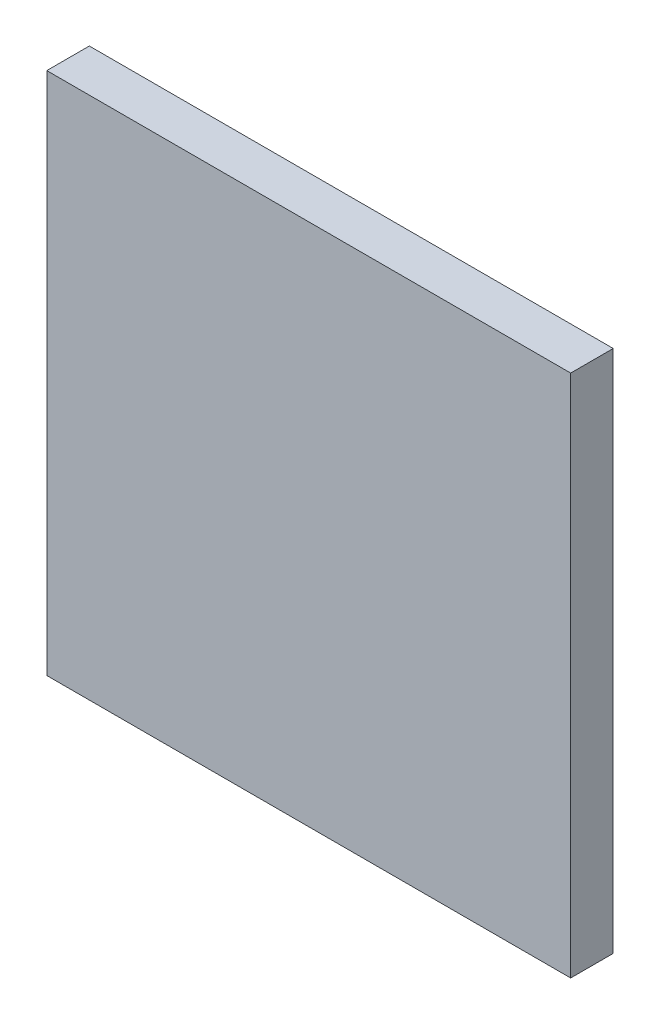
ISO-10303-21;
HEADER;
FILE_DESCRIPTION(('STEP AP214'),'2;1');
FILE_NAME('part.step','',(''),(''),'','','');
FILE_SCHEMA(('AUTOMOTIVE_DESIGN { 1 0 10303 214 1 1 1 1 }'));
ENDSEC;
DATA;
#1=APPLICATION_CONTEXT('core data for automotive mechanical design processes');
#2=APPLICATION_PROTOCOL_DEFINITION('international standard','automotive_design',2000,#1);
#3=PRODUCT_CONTEXT('',#1,'mechanical');
#4=PRODUCT('Part','Part','',(#3));
#5=PRODUCT_RELATED_PRODUCT_CATEGORY('part','',(#4));
#6=PRODUCT_DEFINITION_FORMATION('','',#4);
#7=PRODUCT_DEFINITION_CONTEXT('part definition',#1,'design');
#8=PRODUCT_DEFINITION('design','',#6,#7);
#9=PRODUCT_DEFINITION_SHAPE('','',#8);
#10=(LENGTH_UNIT() NAMED_UNIT(*) SI_UNIT(.MILLI.,.METRE.));
#11=(NAMED_UNIT(*) PLANE_ANGLE_UNIT() SI_UNIT($,.RADIAN.));
#12=(NAMED_UNIT(*) SI_UNIT($,.STERADIAN.) SOLID_ANGLE_UNIT());
#13=UNCERTAINTY_MEASURE_WITH_UNIT(LENGTH_MEASURE(1.E-05),#10,'distance_accuracy_value','');
#14=(GEOMETRIC_REPRESENTATION_CONTEXT(3) GLOBAL_UNCERTAINTY_ASSIGNED_CONTEXT((#13)) GLOBAL_UNIT_ASSIGNED_CONTEXT((#10,
#11,#12)) REPRESENTATION_CONTEXT('',''));
#15=CARTESIAN_POINT('',(0.,0.,0.));
#16=DIRECTION('',(0.,0.,1.));
#17=DIRECTION('',(1.,0.,0.));
#18=AXIS2_PLACEMENT_3D('',#15,#16,#17);
#19=CARTESIAN_POINT('',(4.,4.,0.65));
#20=DIRECTION('',(-1.,0.,0.));
#21=DIRECTION('',(0.,-1.,0.));
#22=AXIS2_PLACEMENT_3D('',#19,#20,#21);
#23=PLANE('',#22);
#24=DIRECTION('',(0.,1.,0.));
#25=VECTOR('',#24,1.);
#26=CARTESIAN_POINT('',(4.,4.,0.));
#27=LINE('',#26,#25);
#28=CARTESIAN_POINT('',(4.,-4.,0.));
#29=VERTEX_POINT('',#28);
#30=CARTESIAN_POINT('',(4.,4.,0.));
#31=VERTEX_POINT('',#30);
#32=EDGE_CURVE('E102',#29,#31,#27,.T.);
#33=ORIENTED_EDGE('',*,*,#32,.T.);
#34=DIRECTION('',(0.,0.,-1.));
#35=VECTOR('',#34,1.);
#36=CARTESIAN_POINT('',(4.,4.,0.65));
#37=LINE('',#36,#35);
#38=CARTESIAN_POINT('',(4.,4.,0.65));
#39=VERTEX_POINT('',#38);
#40=EDGE_CURVE('E11',#39,#31,#37,.T.);
#41=ORIENTED_EDGE('',*,*,#40,.F.);
#42=DIRECTION('',(0.,1.,0.));
#43=VECTOR('',#42,1.);
#44=CARTESIAN_POINT('',(4.,4.,0.65));
#45=LINE('',#44,#43);
#46=CARTESIAN_POINT('',(4.,-4.,0.65));
#47=VERTEX_POINT('',#46);
#48=EDGE_CURVE('E90',#47,#39,#45,.T.);
#49=ORIENTED_EDGE('',*,*,#48,.F.);
#50=DIRECTION('',(0.,0.,-1.));
#51=VECTOR('',#50,1.);
#52=CARTESIAN_POINT('',(4.,-4.,0.65));
#53=LINE('',#52,#51);
#54=EDGE_CURVE('E98',#47,#29,#53,.T.);
#55=ORIENTED_EDGE('',*,*,#54,.T.);
#56=EDGE_LOOP('',(#33,#41,#49,#55));
#57=FACE_BOUND('',#56,.T.);
#58=ADVANCED_FACE('F39',(#57),#23,.F.);
#59=CARTESIAN_POINT('',(-4.,4.,0.65));
#60=DIRECTION('',(0.,-1.,0.));
#61=DIRECTION('',(0.,0.,-1.));
#62=AXIS2_PLACEMENT_3D('',#59,#60,#61);
#63=PLANE('',#62);
#64=DIRECTION('',(-1.,0.,0.));
#65=VECTOR('',#64,1.);
#66=CARTESIAN_POINT('',(-4.,4.,0.));
#67=LINE('',#66,#65);
#68=CARTESIAN_POINT('',(-4.,4.,0.));
#69=VERTEX_POINT('',#68);
#70=EDGE_CURVE('E94',#31,#69,#67,.T.);
#71=ORIENTED_EDGE('',*,*,#70,.T.);
#72=DIRECTION('',(0.,0.,-1.));
#73=VECTOR('',#72,1.);
#74=CARTESIAN_POINT('',(-4.,4.,0.65));
#75=LINE('',#74,#73);
#76=CARTESIAN_POINT('',(-4.,4.,0.65));
#77=VERTEX_POINT('',#76);
#78=EDGE_CURVE('E47',#77,#69,#75,.T.);
#79=ORIENTED_EDGE('',*,*,#78,.F.);
#80=DIRECTION('',(-1.,0.,0.));
#81=VECTOR('',#80,1.);
#82=CARTESIAN_POINT('',(-4.,4.,0.65));
#83=LINE('',#82,#81);
#84=EDGE_CURVE('E85',#39,#77,#83,.T.);
#85=ORIENTED_EDGE('',*,*,#84,.F.);
#86=ORIENTED_EDGE('',*,*,#40,.T.);
#87=EDGE_LOOP('',(#71,#79,#85,#86));
#88=FACE_BOUND('',#87,.T.);
#89=ADVANCED_FACE('F93',(#88),#63,.F.);
#90=CARTESIAN_POINT('',(-4.,4.,0.65));
#91=DIRECTION('',(1.,0.,0.));
#92=DIRECTION('',(0.,0.,-1.));
#93=AXIS2_PLACEMENT_3D('',#90,#91,#92);
#94=PLANE('',#93);
#95=DIRECTION('',(0.,-1.,0.));
#96=VECTOR('',#95,1.);
#97=CARTESIAN_POINT('',(-4.,4.,0.));
#98=LINE('',#97,#96);
#99=CARTESIAN_POINT('',(-4.,-4.,0.));
#100=VERTEX_POINT('',#99);
#101=EDGE_CURVE('E72',#69,#100,#98,.T.);
#102=ORIENTED_EDGE('',*,*,#101,.T.);
#103=DIRECTION('',(0.,0.,-1.));
#104=VECTOR('',#103,1.);
#105=CARTESIAN_POINT('',(-4.,-4.,0.65));
#106=LINE('',#105,#104);
#107=CARTESIAN_POINT('',(-4.,-4.,0.65));
#108=VERTEX_POINT('',#107);
#109=EDGE_CURVE('E95',#108,#100,#106,.T.);
#110=ORIENTED_EDGE('',*,*,#109,.F.);
#111=DIRECTION('',(0.,-1.,0.));
#112=VECTOR('',#111,1.);
#113=CARTESIAN_POINT('',(-4.,4.,0.65));
#114=LINE('',#113,#112);
#115=EDGE_CURVE('E88',#77,#108,#114,.T.);
#116=ORIENTED_EDGE('',*,*,#115,.F.);
#117=ORIENTED_EDGE('',*,*,#78,.T.);
#118=EDGE_LOOP('',(#102,#110,#116,#117));
#119=FACE_BOUND('',#118,.T.);
#120=ADVANCED_FACE('F96',(#119),#94,.F.);
#121=CARTESIAN_POINT('',(-4.,-4.,0.65));
#122=DIRECTION('',(0.,1.,0.));
#123=DIRECTION('',(-1.,0.,0.));
#124=AXIS2_PLACEMENT_3D('',#121,#122,#123);
#125=PLANE('',#124);
#126=DIRECTION('',(1.,0.,0.));
#127=VECTOR('',#126,1.);
#128=CARTESIAN_POINT('',(-4.,-4.,0.));
#129=LINE('',#128,#127);
#130=EDGE_CURVE('E78',#100,#29,#129,.T.);
#131=ORIENTED_EDGE('',*,*,#130,.T.);
#132=ORIENTED_EDGE('',*,*,#54,.F.);
#133=DIRECTION('',(1.,0.,0.));
#134=VECTOR('',#133,1.);
#135=CARTESIAN_POINT('',(-4.,-4.,0.65));
#136=LINE('',#135,#134);
#137=EDGE_CURVE('E55',#108,#47,#136,.T.);
#138=ORIENTED_EDGE('',*,*,#137,.F.);
#139=ORIENTED_EDGE('',*,*,#109,.T.);
#140=EDGE_LOOP('',(#131,#132,#138,#139));
#141=FACE_BOUND('',#140,.T.);
#142=ADVANCED_FACE('F109',(#141),#125,.F.);
#143=CARTESIAN_POINT('',(0.,0.,0.65));
#144=DIRECTION('',(0.,0.,1.));
#145=DIRECTION('',(1.,0.,0.));
#146=AXIS2_PLACEMENT_3D('',#143,#144,#145);
#147=PLANE('',#146);
#148=ORIENTED_EDGE('',*,*,#48,.T.);
#149=ORIENTED_EDGE('',*,*,#84,.T.);
#150=ORIENTED_EDGE('',*,*,#115,.T.);
#151=ORIENTED_EDGE('',*,*,#137,.T.);
#152=EDGE_LOOP('',(#148,#149,#150,#151));
#153=FACE_BOUND('',#152,.T.);
#154=ADVANCED_FACE('F86',(#153),#147,.T.);
#155=CARTESIAN_POINT('',(0.,0.,0.));
#156=DIRECTION('',(0.,0.,1.));
#157=DIRECTION('',(1.,0.,0.));
#158=AXIS2_PLACEMENT_3D('',#155,#156,#157);
#159=PLANE('',#158);
#160=ORIENTED_EDGE('',*,*,#32,.F.);
#161=ORIENTED_EDGE('',*,*,#130,.F.);
#162=ORIENTED_EDGE('',*,*,#101,.F.);
#163=ORIENTED_EDGE('',*,*,#70,.F.);
#164=EDGE_LOOP('',(#160,#161,#162,#163));
#165=FACE_BOUND('',#164,.T.);
#166=ADVANCED_FACE('F112',(#165),#159,.F.);
#167=CLOSED_SHELL('',(#58,#89,#120,#142,#154,#166));
#168=MANIFOLD_SOLID_BREP('B2',#167);
#169=ADVANCED_BREP_SHAPE_REPRESENTATION('',(#18,#168),#14);
#170=SHAPE_DEFINITION_REPRESENTATION(#9,#169);
ENDSEC;
END-ISO-10303-21;
